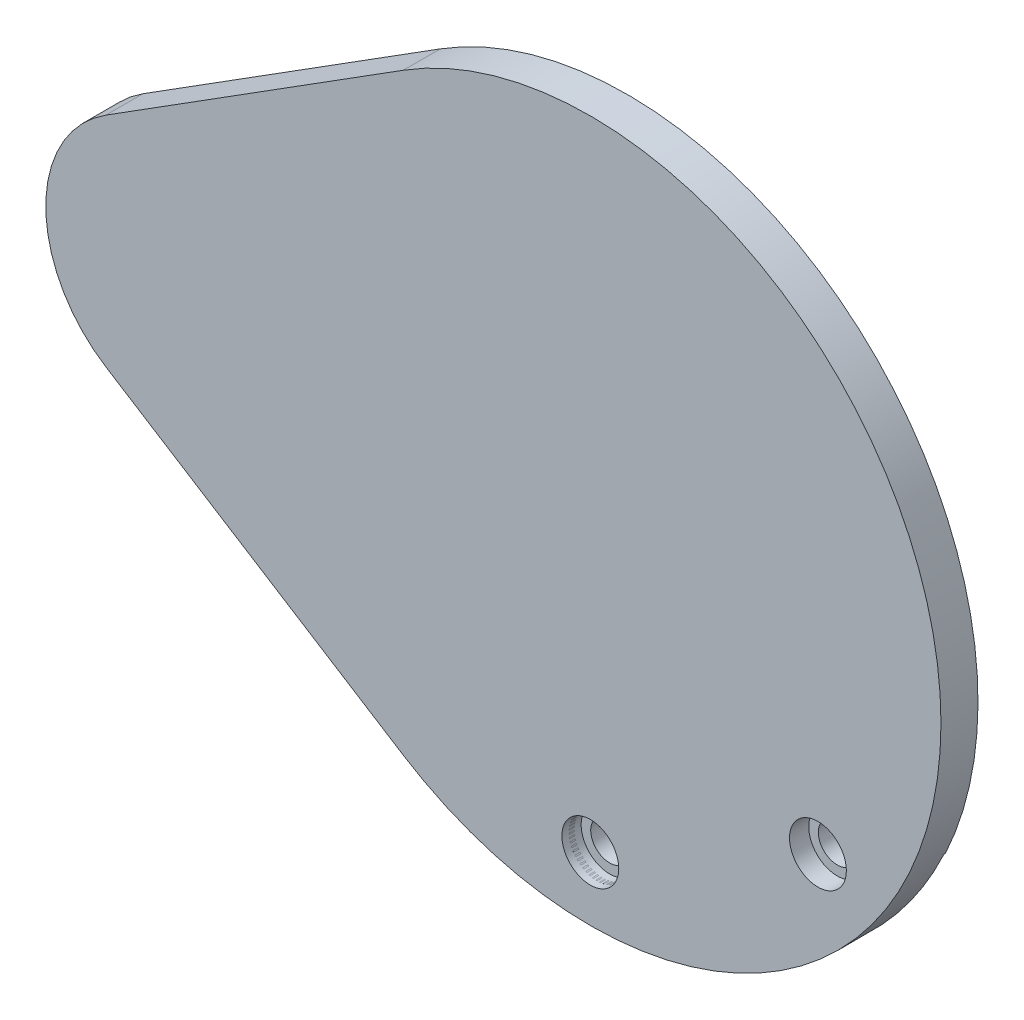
from build123d import *

# Parameters (mm, degrees)
BASE_EXTRUDE_DEPTH = 24.892
SKETCH3_R          = 19.1135
CUT_EXTRUDE1_DEPTH = 12.954
SKETCH2_R          = 12.7
CUT_EXTRUDE2_DEPTH = 437.141867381
SKETCH4_R          = 63.5
CUT_EXTRUDE3_DEPTH = 1.016
SKETCH12_W         = 2.0955
SKETCH12_H         = 3.556


with BuildPart() as part:
    # Sketch1 → Base-Extrude (new body)
    with BuildSketch(Plane.XY):
        with BuildLine():
            Line((-325.647097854, 73.333540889), (-125.748319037, 199.397798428))
            ThreePointArc((-125.748319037, 199.397798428), (235.7374, 0), (-125.748319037, -199.397798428))
            Line((-125.748319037, -199.397798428), (-325.647097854, -73.333540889))
            ThreePointArc((-325.647097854, -73.333540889), (-366.098340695, 0), (-325.647097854, 73.333540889))
        make_face()
    extrude(amount=BASE_EXTRUDE_DEPTH)

    # Sketch3 → Cut-Extrude1 (cut)
    with BuildSketch(Plane.XY.offset(24.892)):
        with Locations((153.008626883, -117.697925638)):
            Circle(SKETCH3_R)
        with Locations((0, -193.04)):
            Circle(SKETCH3_R)
    extrude(amount=-CUT_EXTRUDE1_DEPTH, mode=Mode.SUBTRACT)

    # Sketch2 → Cut-Extrude2 (cut, through all)
    with BuildSketch(Plane.XY.offset(24.892)):
        with Locations((0, -193.04)):
            Circle(SKETCH2_R)
        with Locations((153.008626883, -117.697925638)):
            Circle(SKETCH2_R)
    extrude(amount=-CUT_EXTRUDE2_DEPTH, mode=Mode.SUBTRACT)

    # Sketch4 → Cut-Extrude3 (cut)
    with BuildSketch(Plane(origin=(0, 0, 0), x_dir=(-1, 0, 0), z_dir=(0, 0, -1))):
        with Locations((0, -193.04)):
            Circle(SKETCH4_R)
        with Locations((-153.008626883, -117.697925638)):
            Circle(SKETCH4_R)
    extrude(amount=-CUT_EXTRUDE3_DEPTH, mode=Mode.SUBTRACT)

    # Cut-Sweep1: sweep along a path in Sketch13
    with BuildLine(Plane.XY.offset(18.415)) as cut_sweep1_path:
        CenterArc((0, -193.04), 21.209, 0, 360)
    # Sketch12 → Cut-Sweep1 (sweep, cut)
    with BuildSketch(Plane(origin=(0, -193.675, 0), x_dir=(-1, 0, 0), z_dir=(0, 1, 0))):
        with Locations((-20.16125, 18.415)):
            Rectangle(SKETCH12_W, SKETCH12_H)
    sweep(path=cut_sweep1_path.line, mode=Mode.SUBTRACT)


solid = part.part
